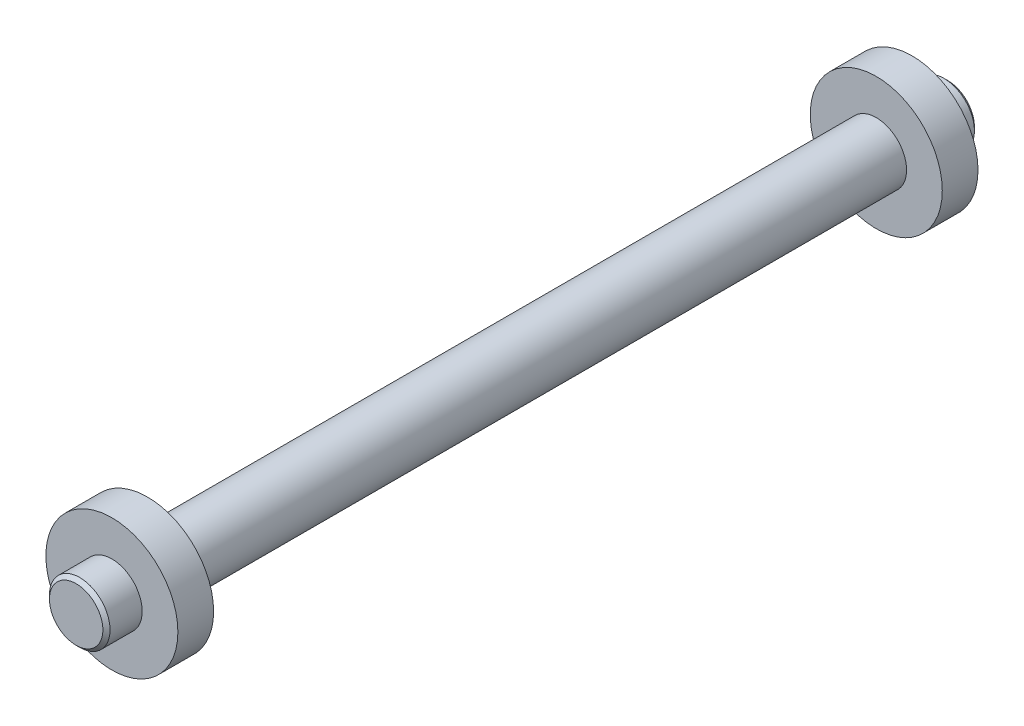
ISO-10303-21;
HEADER;
FILE_DESCRIPTION(('STEP AP214'),'2;1');
FILE_NAME('part.step','',(''),(''),'','','');
FILE_SCHEMA(('AUTOMOTIVE_DESIGN { 1 0 10303 214 1 1 1 1 }'));
ENDSEC;
DATA;
#1=APPLICATION_CONTEXT('core data for automotive mechanical design processes');
#2=APPLICATION_PROTOCOL_DEFINITION('international standard','automotive_design',2000,#1);
#3=PRODUCT_CONTEXT('',#1,'mechanical');
#4=PRODUCT('Part','Part','',(#3));
#5=PRODUCT_RELATED_PRODUCT_CATEGORY('part','',(#4));
#6=PRODUCT_DEFINITION_FORMATION('','',#4);
#7=PRODUCT_DEFINITION_CONTEXT('part definition',#1,'design');
#8=PRODUCT_DEFINITION('design','',#6,#7);
#9=PRODUCT_DEFINITION_SHAPE('','',#8);
#10=(LENGTH_UNIT() NAMED_UNIT(*) SI_UNIT(.MILLI.,.METRE.));
#11=(NAMED_UNIT(*) PLANE_ANGLE_UNIT() SI_UNIT($,.RADIAN.));
#12=(NAMED_UNIT(*) SI_UNIT($,.STERADIAN.) SOLID_ANGLE_UNIT());
#13=UNCERTAINTY_MEASURE_WITH_UNIT(LENGTH_MEASURE(1.E-05),#10,'distance_accuracy_value','');
#14=(GEOMETRIC_REPRESENTATION_CONTEXT(3) GLOBAL_UNCERTAINTY_ASSIGNED_CONTEXT((#13)) GLOBAL_UNIT_ASSIGNED_CONTEXT((#10,
#11,#12)) REPRESENTATION_CONTEXT('',''));
#15=CARTESIAN_POINT('',(0.,0.,0.));
#16=DIRECTION('',(0.,0.,1.));
#17=DIRECTION('',(1.,0.,0.));
#18=AXIS2_PLACEMENT_3D('',#15,#16,#17);
#19=CARTESIAN_POINT('',(0.,1.06,15.25));
#20=DIRECTION('',(0.,0.,-1.));
#21=DIRECTION('',(-1.,0.,0.));
#22=AXIS2_PLACEMENT_3D('',#19,#20,#21);
#23=PLANE('',#22);
#24=CARTESIAN_POINT('',(0.,0.,15.25));
#25=DIRECTION('',(0.,0.,-1.));
#26=DIRECTION('',(-1.,0.,0.));
#27=AXIS2_PLACEMENT_3D('',#24,#25,#26);
#28=CIRCLE('',#27,0.935000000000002);
#29=CARTESIAN_POINT('',(-0.935000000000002,0.,15.25));
#30=VERTEX_POINT('',#29);
#31=EDGE_CURVE('E36',#30,#30,#28,.F.);
#32=ORIENTED_EDGE('',*,*,#31,.T.);
#33=EDGE_LOOP('',(#32));
#34=FACE_BOUND('',#33,.T.);
#35=ADVANCED_FACE('F29',(#34),#23,.F.);
#36=CARTESIAN_POINT('',(0.,0.,-15.25));
#37=DIRECTION('',(0.,0.,1.));
#38=DIRECTION('',(1.,0.,0.));
#39=AXIS2_PLACEMENT_3D('',#36,#37,#38);
#40=PLANE('',#39);
#41=CARTESIAN_POINT('',(0.,0.,-15.25));
#42=DIRECTION('',(0.,0.,1.));
#43=DIRECTION('',(1.,0.,0.));
#44=AXIS2_PLACEMENT_3D('',#41,#42,#43);
#45=CIRCLE('',#44,0.934999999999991);
#46=CARTESIAN_POINT('',(0.934999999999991,0.,-15.25));
#47=VERTEX_POINT('',#46);
#48=EDGE_CURVE('E40',#47,#47,#45,.F.);
#49=ORIENTED_EDGE('',*,*,#48,.T.);
#50=EDGE_LOOP('',(#49));
#51=FACE_BOUND('',#50,.T.);
#52=ADVANCED_FACE('F120',(#51),#40,.F.);
#53=CARTESIAN_POINT('',(0.,0.,15.25));
#54=DIRECTION('',(0.,0.,1.));
#55=DIRECTION('',(1.,0.,0.));
#56=AXIS2_PLACEMENT_3D('',#53,#54,#55);
#57=CYLINDRICAL_SURFACE('',#56,1.06);
#58=CARTESIAN_POINT('',(0.,0.,-15.125));
#59=DIRECTION('',(0.,0.,1.));
#60=DIRECTION('',(1.,0.,0.));
#61=AXIS2_PLACEMENT_3D('',#58,#59,#60);
#62=CIRCLE('',#61,1.06);
#63=CARTESIAN_POINT('',(1.06,0.,-15.125));
#64=VERTEX_POINT('',#63);
#65=EDGE_CURVE('E44',#64,#64,#62,.T.);
#66=ORIENTED_EDGE('',*,*,#65,.T.);
#67=EDGE_LOOP('',(#66));
#68=FACE_BOUND('',#67,.T.);
#69=CARTESIAN_POINT('',(0.,0.,-14.));
#70=DIRECTION('',(0.,0.,1.));
#71=DIRECTION('',(1.,0.,0.));
#72=AXIS2_PLACEMENT_3D('',#69,#70,#71);
#73=CIRCLE('',#72,1.06);
#74=CARTESIAN_POINT('',(1.06,0.,-14.));
#75=VERTEX_POINT('',#74);
#76=EDGE_CURVE('E49',#75,#75,#73,.T.);
#77=ORIENTED_EDGE('',*,*,#76,.F.);
#78=EDGE_LOOP('',(#77));
#79=FACE_BOUND('',#78,.T.);
#80=ADVANCED_FACE('F115',(#68,#79),#57,.T.);
#81=CARTESIAN_POINT('',(0.,1.06,-14.));
#82=DIRECTION('',(0.,0.,1.));
#83=DIRECTION('',(1.,0.,0.));
#84=AXIS2_PLACEMENT_3D('',#81,#82,#83);
#85=PLANE('',#84);
#86=CARTESIAN_POINT('',(0.,0.,-14.));
#87=DIRECTION('',(0.,0.,1.));
#88=DIRECTION('',(1.,0.,0.));
#89=AXIS2_PLACEMENT_3D('',#86,#87,#88);
#90=CIRCLE('',#89,2.31);
#91=CARTESIAN_POINT('',(2.31,0.,-14.));
#92=VERTEX_POINT('',#91);
#93=EDGE_CURVE('E52',#92,#92,#90,.T.);
#94=ORIENTED_EDGE('',*,*,#93,.F.);
#95=EDGE_LOOP('',(#94));
#96=FACE_BOUND('',#95,.T.);
#97=ORIENTED_EDGE('',*,*,#76,.T.);
#98=EDGE_LOOP('',(#97));
#99=FACE_BOUND('',#98,.T.);
#100=ADVANCED_FACE('F109',(#96,#99),#85,.F.);
#101=CARTESIAN_POINT('',(0.,0.,15.25));
#102=DIRECTION('',(0.,0.,1.));
#103=DIRECTION('',(1.,0.,0.));
#104=AXIS2_PLACEMENT_3D('',#101,#102,#103);
#105=CYLINDRICAL_SURFACE('',#104,2.31);
#106=CARTESIAN_POINT('',(0.,0.,-12.75));
#107=DIRECTION('',(0.,0.,1.));
#108=DIRECTION('',(1.,0.,0.));
#109=AXIS2_PLACEMENT_3D('',#106,#107,#108);
#110=CIRCLE('',#109,2.31);
#111=CARTESIAN_POINT('',(2.31,0.,-12.75));
#112=VERTEX_POINT('',#111);
#113=EDGE_CURVE('E55',#112,#112,#110,.T.);
#114=ORIENTED_EDGE('',*,*,#113,.F.);
#115=EDGE_LOOP('',(#114));
#116=FACE_BOUND('',#115,.T.);
#117=ORIENTED_EDGE('',*,*,#93,.T.);
#118=EDGE_LOOP('',(#117));
#119=FACE_BOUND('',#118,.T.);
#120=ADVANCED_FACE('F103',(#116,#119),#105,.T.);
#121=CARTESIAN_POINT('',(0.,2.30999999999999,-12.75));
#122=DIRECTION('',(0.,0.,-1.));
#123=DIRECTION('',(-1.,0.,0.));
#124=AXIS2_PLACEMENT_3D('',#121,#122,#123);
#125=PLANE('',#124);
#126=CARTESIAN_POINT('',(0.,0.,-12.75));
#127=DIRECTION('',(0.,0.,1.));
#128=DIRECTION('',(1.,0.,0.));
#129=AXIS2_PLACEMENT_3D('',#126,#127,#128);
#130=CIRCLE('',#129,1.06);
#131=CARTESIAN_POINT('',(1.06,0.,-12.75));
#132=VERTEX_POINT('',#131);
#133=EDGE_CURVE('E58',#132,#132,#130,.T.);
#134=ORIENTED_EDGE('',*,*,#133,.F.);
#135=EDGE_LOOP('',(#134));
#136=FACE_BOUND('',#135,.T.);
#137=ORIENTED_EDGE('',*,*,#113,.T.);
#138=EDGE_LOOP('',(#137));
#139=FACE_BOUND('',#138,.T.);
#140=ADVANCED_FACE('F97',(#136,#139),#125,.F.);
#141=CARTESIAN_POINT('',(0.,0.,15.25));
#142=DIRECTION('',(0.,0.,1.));
#143=DIRECTION('',(1.,0.,0.));
#144=AXIS2_PLACEMENT_3D('',#141,#142,#143);
#145=CYLINDRICAL_SURFACE('',#144,1.06);
#146=CARTESIAN_POINT('',(0.,0.,12.75));
#147=DIRECTION('',(0.,0.,1.));
#148=DIRECTION('',(1.,0.,0.));
#149=AXIS2_PLACEMENT_3D('',#146,#147,#148);
#150=CIRCLE('',#149,1.06);
#151=CARTESIAN_POINT('',(1.06,0.,12.75));
#152=VERTEX_POINT('',#151);
#153=EDGE_CURVE('E61',#152,#152,#150,.T.);
#154=ORIENTED_EDGE('',*,*,#153,.F.);
#155=EDGE_LOOP('',(#154));
#156=FACE_BOUND('',#155,.T.);
#157=ORIENTED_EDGE('',*,*,#133,.T.);
#158=EDGE_LOOP('',(#157));
#159=FACE_BOUND('',#158,.T.);
#160=ADVANCED_FACE('F91',(#156,#159),#145,.T.);
#161=CARTESIAN_POINT('',(0.,1.06,12.75));
#162=DIRECTION('',(0.,0.,1.));
#163=DIRECTION('',(1.,0.,0.));
#164=AXIS2_PLACEMENT_3D('',#161,#162,#163);
#165=PLANE('',#164);
#166=CARTESIAN_POINT('',(0.,0.,12.75));
#167=DIRECTION('',(0.,0.,1.));
#168=DIRECTION('',(1.,0.,0.));
#169=AXIS2_PLACEMENT_3D('',#166,#167,#168);
#170=CIRCLE('',#169,2.31);
#171=CARTESIAN_POINT('',(2.31,0.,12.75));
#172=VERTEX_POINT('',#171);
#173=EDGE_CURVE('E64',#172,#172,#170,.T.);
#174=ORIENTED_EDGE('',*,*,#173,.F.);
#175=EDGE_LOOP('',(#174));
#176=FACE_BOUND('',#175,.T.);
#177=ORIENTED_EDGE('',*,*,#153,.T.);
#178=EDGE_LOOP('',(#177));
#179=FACE_BOUND('',#178,.T.);
#180=ADVANCED_FACE('F85',(#176,#179),#165,.F.);
#181=CARTESIAN_POINT('',(0.,0.,15.25));
#182=DIRECTION('',(0.,0.,1.));
#183=DIRECTION('',(1.,0.,0.));
#184=AXIS2_PLACEMENT_3D('',#181,#182,#183);
#185=CYLINDRICAL_SURFACE('',#184,2.31);
#186=CARTESIAN_POINT('',(0.,0.,14.));
#187=DIRECTION('',(0.,0.,1.));
#188=DIRECTION('',(1.,0.,0.));
#189=AXIS2_PLACEMENT_3D('',#186,#187,#188);
#190=CIRCLE('',#189,2.31);
#191=CARTESIAN_POINT('',(2.31,0.,14.));
#192=VERTEX_POINT('',#191);
#193=EDGE_CURVE('E67',#192,#192,#190,.T.);
#194=ORIENTED_EDGE('',*,*,#193,.F.);
#195=EDGE_LOOP('',(#194));
#196=FACE_BOUND('',#195,.T.);
#197=ORIENTED_EDGE('',*,*,#173,.T.);
#198=EDGE_LOOP('',(#197));
#199=FACE_BOUND('',#198,.T.);
#200=ADVANCED_FACE('F79',(#196,#199),#185,.T.);
#201=CARTESIAN_POINT('',(0.,2.31,14.));
#202=DIRECTION('',(0.,0.,-1.));
#203=DIRECTION('',(-1.,0.,0.));
#204=AXIS2_PLACEMENT_3D('',#201,#202,#203);
#205=PLANE('',#204);
#206=CARTESIAN_POINT('',(0.,0.,14.));
#207=DIRECTION('',(0.,0.,1.));
#208=DIRECTION('',(1.,0.,0.));
#209=AXIS2_PLACEMENT_3D('',#206,#207,#208);
#210=CIRCLE('',#209,1.06);
#211=CARTESIAN_POINT('',(1.06,0.,14.));
#212=VERTEX_POINT('',#211);
#213=EDGE_CURVE('E70',#212,#212,#210,.T.);
#214=ORIENTED_EDGE('',*,*,#213,.F.);
#215=EDGE_LOOP('',(#214));
#216=FACE_BOUND('',#215,.T.);
#217=ORIENTED_EDGE('',*,*,#193,.T.);
#218=EDGE_LOOP('',(#217));
#219=FACE_BOUND('',#218,.T.);
#220=ADVANCED_FACE('F76',(#216,#219),#205,.F.);
#221=CARTESIAN_POINT('',(0.,0.,15.25));
#222=DIRECTION('',(0.,0.,1.));
#223=DIRECTION('',(1.,0.,0.));
#224=AXIS2_PLACEMENT_3D('',#221,#222,#223);
#225=CYLINDRICAL_SURFACE('',#224,1.06);
#226=CARTESIAN_POINT('',(0.,0.,15.125));
#227=DIRECTION('',(0.,0.,-1.));
#228=DIRECTION('',(-1.,0.,0.));
#229=AXIS2_PLACEMENT_3D('',#226,#227,#228);
#230=CIRCLE('',#229,1.06);
#231=CARTESIAN_POINT('',(-1.06,0.,15.125));
#232=VERTEX_POINT('',#231);
#233=EDGE_CURVE('E10',#232,#232,#230,.T.);
#234=ORIENTED_EDGE('',*,*,#233,.T.);
#235=EDGE_LOOP('',(#234));
#236=FACE_BOUND('',#235,.T.);
#237=ORIENTED_EDGE('',*,*,#213,.T.);
#238=EDGE_LOOP('',(#237));
#239=FACE_BOUND('',#238,.T.);
#240=ADVANCED_FACE('F74',(#236,#239),#225,.T.);
#241=CARTESIAN_POINT('',(0.,0.,-15.125));
#242=DIRECTION('',(0.,0.,1.));
#243=DIRECTION('',(1.,0.,0.));
#244=AXIS2_PLACEMENT_3D('',#241,#242,#243);
#245=CONICAL_SURFACE('',#244,1.06,0.785398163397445);
#246=ORIENTED_EDGE('',*,*,#48,.F.);
#247=EDGE_LOOP('',(#246));
#248=FACE_BOUND('',#247,.T.);
#249=ORIENTED_EDGE('',*,*,#65,.F.);
#250=EDGE_LOOP('',(#249));
#251=FACE_BOUND('',#250,.T.);
#252=ADVANCED_FACE('F132',(#248,#251),#245,.T.);
#253=CARTESIAN_POINT('',(0.,0.,15.25));
#254=DIRECTION('',(0.,0.,-1.));
#255=DIRECTION('',(-1.,0.,0.));
#256=AXIS2_PLACEMENT_3D('',#253,#254,#255);
#257=CONICAL_SURFACE('',#256,0.935000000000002,0.785398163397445);
#258=ORIENTED_EDGE('',*,*,#233,.F.);
#259=EDGE_LOOP('',(#258));
#260=FACE_BOUND('',#259,.T.);
#261=ORIENTED_EDGE('',*,*,#31,.F.);
#262=EDGE_LOOP('',(#261));
#263=FACE_BOUND('',#262,.T.);
#264=ADVANCED_FACE('F31',(#260,#263),#257,.T.);
#265=CLOSED_SHELL('',(#35,#52,#80,#100,#120,#140,#160,#180,#200,#220,#240,#252,#264));
#266=MANIFOLD_SOLID_BREP('B2',#265);
#267=ADVANCED_BREP_SHAPE_REPRESENTATION('',(#18,#266),#14);
#268=SHAPE_DEFINITION_REPRESENTATION(#9,#267);
ENDSEC;
END-ISO-10303-21;
